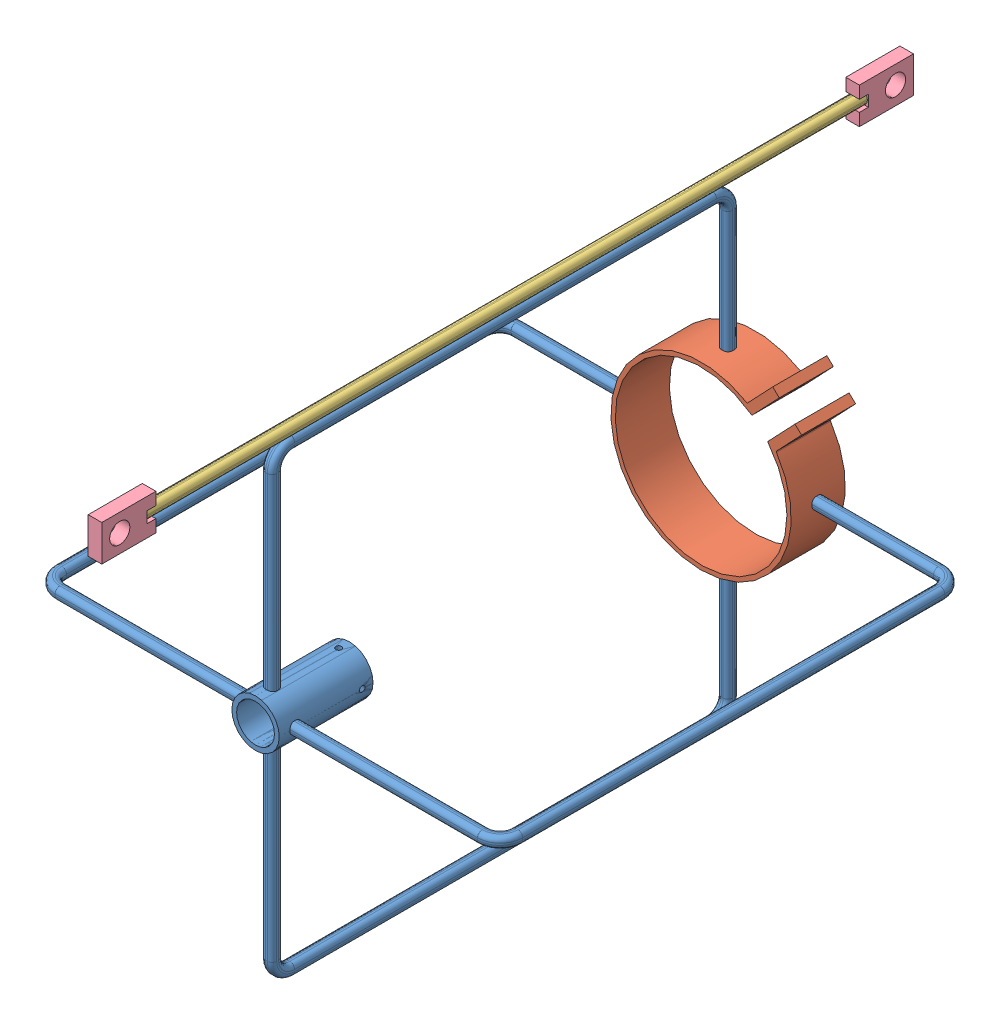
SolidWorks assembly MOORING FRAME.SLDASM, configuration Default (file format 3400). Lengths in mm.
Overall size (329.15 345.82 571.5).
7 component instances, 4 part files, 16 mates.
Components (placement in the parent):
- CAGE ARM-1: CAGE ARM.SLDPRT [Default] at origin size (33.4 329.15 336.55)
- CAGE ARM-2: CAGE ARM.SLDPRT [Default] x (0 -1 0) z (0 0 1) size (33.4 329.15 336.55)
- CAGE CLAMP-1: CAGE CLAMP.SLDPRT [Default] at (0 0 -15.24) x (0.725338 -0.688392 0) z (0 0 1) size (127 151.5 38.1)
- CAGE MOORING ROD-1: CAGE MOORING ROD.SLDPRT [Default] at (0 168.579 163.83) size (7.94 7.94 508)
- CAGE MOORING EYE-1: CAGE MOORING EYE.SLDPRT [Default] at (0.0127 168.579 430.53) x (0 0 1) z (1 0 0) size (38.1 25.4 9.55)
- CAGE MOORING EYE-2: CAGE MOORING EYE.SLDPRT [Default] at (-0.0127 168.579 -102.87) x (0 0 -1) z (1 0 0) size (38.1 25.4 9.55)
- 3D ACM-1: 3D ACM.SLDASM [Default] at (0 0 41.91) x (0 0 1) z (-0.71367 -0.700482 0) (suppressed, hidden)
Mates (geometry in assembly coordinates):
- Coincident1: coincident aligned: plane of CAGE ARM-1 through (0 0 336.55) normal (0 0 1); plane of CAGE ARM-2 through (0 0 336.55) normal (0 0 1)
- Concentric2: concentric anti-aligned: cylinder of CAGE ARM-1; cylinder of CAGE ARM-2
- Concentric3: concentric aligned: cylinder of CAGE ARM-1; cylinder of CAGE ARM-2
- Concentric4: concentric aligned: cylinder of CAGE ARM-2; cylinder of CAGE CLAMP-1
- Distance1: distance = 247.65 mm anti-aligned: plane of CAGE ARM-2 through (0 0 270.51) normal (0 0 -1); plane of CAGE CLAMP-1 through (53.745 35.2289 22.86) normal (0 0 1)
- Coincident3: coincident anti-aligned: plane of CAGE ARM-1 through (-18.8912 164.6102 15.875) normal (0 1 0); plane of CAGE MOORING ROD-1 through (3.9688 164.6102 417.83) normal (0 -1 0)
- Coincident4: coincident aligned: plane of CAGE ARM-1 through (3.9688 16.2221 328.93) normal (1 0 0); plane of CAGE MOORING ROD-1 through (3.9688 172.5477 417.83) normal (1 0 0)
- Coincident5: coincident anti-aligned: plane of CAGE MOORING ROD-1 through (3.9688 164.6102 417.83) normal (0 -1 0); plane of CAGE MOORING EYE-1 through (4.7879 164.6102 417.83) normal (0 1 0)
- Distance2: distance = 0.7937 mm aligned: plane of CAGE MOORING ROD-1 through (-3.9688 172.5477 417.83) normal (-1 0 0); plane of CAGE MOORING EYE-1 through (-4.7625 172.5477 449.58) normal (-1 0 0)
- Coincident6: coincident anti-aligned: plane of CAGE MOORING ROD-1 through (3.9688 164.6102 417.83) normal (0 0 1); plane of CAGE MOORING EYE-1 through (4.7879 164.6102 417.83) normal (0 0 -1)
- Coincident7: coincident anti-aligned: plane of CAGE MOORING ROD-1 through (3.9688 164.6102 417.83) normal (0 -1 0); plane of CAGE MOORING EYE-2 through (4.7625 164.6102 -90.17) normal (0 1 0)
- Distance3: distance = 0.7937 mm aligned: plane of CAGE MOORING ROD-1 through (3.9688 172.5477 417.83) normal (1 0 0); plane of CAGE MOORING EYE-2 through (4.7625 164.6102 -121.92) normal (1 0 0)
- Coincident8: coincident anti-aligned: plane of CAGE MOORING ROD-1 through (3.9688 164.6102 -90.17) normal (0 0 -1); plane of CAGE MOORING EYE-2 through (4.7625 172.5477 -90.17) normal (0 0 1)
- Distance4: distance = 88.9 mm anti-aligned: plane of CAGE ARM-1 through (0 0 328.93) normal (0 0 1); plane of CAGE MOORING EYE-1 through (4.7879 164.6102 417.83) normal (0 0 -1)
- Concentric5: concentric anti-aligned: cylinder of CAGE CLAMP-1; cylinder of ?
- Distance5: distance = 3.175 mm anti-aligned: plane of CAGE CLAMP-1 through (53.745 35.2289 22.86) normal (0 0 1); plane of ? through (-54.3423 34.3104 26.035) normal (0 0 -1)
